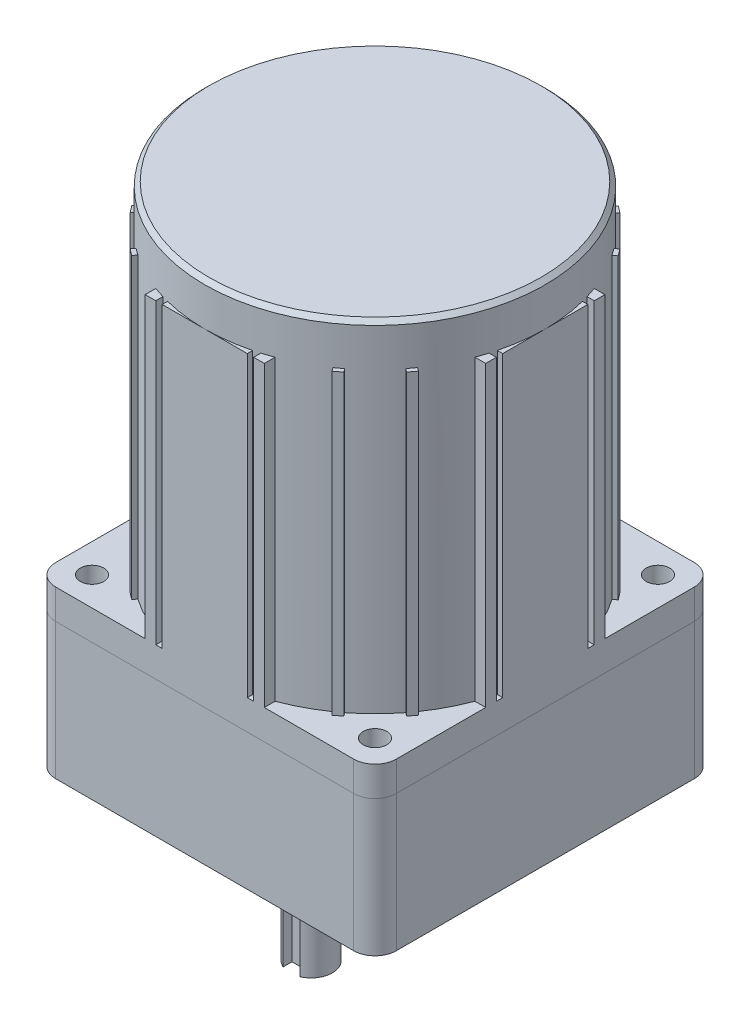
from build123d import *
from build123d.topology import SkipClean

# Parameters (mm, degrees)
SKETCH1_W            = 80
SKETCH1_H            = 80
BOSS_EXTRUDE1_DEPTH  = 87
SKETCH2_OUTSIDE_W    = 110.544
SKETCH2_OUTSIDE_H    = 110.544
SKETCH2_OUTSIDE_R    = 40
CUT_EXTRUDE1_DEPTH   = 10
SKETCH4_R            = 2.25
CUT_EXTRUDE2_DEPTH   = 20
SKETCH5_W            = 80
SKETCH5_H            = 80
BOSS_EXTRUDE2_DEPTH  = 32
SKETCH6_R            = 2.75
CUT_EXTRUDE3_DEPTH   = 165.198051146
SKETCH7_R            = 36.5
CUT_EXTRUDE4_DEPTH   = 2
SKETCH8_R            = 17
BOSS_EXTRUDE3_DEPTH  = 5
SKETCH9_R            = 5
BOSS_EXTRUDE4_DEPTH  = 29
FILLET1_R            = 5
CHAMFER1_SIZE        = 1
CUT_EXTRUDE6_DEPTH   = 70
MIRROR3_COPY_1_DEPTH = 70
FILLET3_R            = 5
CUT_EXTRUDE7_DEPTH   = 2.5


with BuildPart() as part:
    # Sketch1 → Boss-Extrude1 (new body)
    with BuildSketch(Plane(origin=(0, 0, 0), x_dir=(1, 0, 0), z_dir=(0, 1, 0))):
        with Locations((40, -40)):
            Rectangle(SKETCH1_W, SKETCH1_H)
    extrude(amount=BOSS_EXTRUDE1_DEPTH)

    # Sketch2 outside → Cut-Extrude1 (cut)
    with BuildSketch(Plane(origin=(0, 87, 0), x_dir=(1, 0, 0), z_dir=(0, 1, 0))):
        with Locations((40, -40)):
            Rectangle(SKETCH2_OUTSIDE_W, SKETCH2_OUTSIDE_H)
        with Locations(Location((40, -40, 0), (0, 0, 270))):
            Circle(SKETCH2_OUTSIDE_R, mode=Mode.SUBTRACT)
    extrude(amount=-CUT_EXTRUDE1_DEPTH, mode=Mode.SUBTRACT)

    # Sketch4 → Cut-Extrude2 (cut)
    with BuildSketch(Plane.XZ):
        with Locations(Location((64.748737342, 15.251262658, 0), (0, 0, 270))):
            Circle(SKETCH4_R)
        with Locations(Location((15.251262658, 15.251262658, 0), (0, 0, 90))):
            Circle(SKETCH4_R)
        with Locations(Location((15.251262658, 64.748737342, 0), (0, 0, 270))):
            Circle(SKETCH4_R)
        with Locations(Location((64.748737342, 64.748737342, 0), (0, 0, 90))):
            Circle(SKETCH4_R)
    extrude(amount=-CUT_EXTRUDE2_DEPTH, mode=Mode.SUBTRACT)


with BuildPart() as body_2:
    # Sketch5 → Boss-Extrude2 (new body)
    with BuildSketch(Plane(origin=(0, 0, 0), x_dir=(-1, 0, 0), z_dir=(0, -1, 0))):
        with Locations((-40, -40)):
            Rectangle(SKETCH5_W, SKETCH5_H)
    extrude(amount=BOSS_EXTRUDE2_DEPTH)


with BuildPart() as cut_extrude3_tool:
    # Sketch6 → Cut-Extrude3 (new, through all)
    with BuildSketch(Plane.XZ.offset(32)):
        with Locations(Location((6.765981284, 73.234018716, 0), (0, 0, 270))):
            Circle(SKETCH6_R)
        with Locations(Location((6.765981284, 6.765981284, 0), (0, 0, 270))):
            Circle(SKETCH6_R)
        with Locations(Location((73.234018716, 73.234018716, 0), (0, 0, 270))):
            Circle(SKETCH6_R)
        with Locations(Location((73.234018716, 6.765981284, 0), (0, 0, 270))):
            Circle(SKETCH6_R)
    extrude(amount=-CUT_EXTRUDE3_DEPTH)


with BuildPart() as part_1:
    add(part.part)

    # Cut-Extrude3: cut by cut_extrude3_tool
    add(cut_extrude3_tool.part, mode=Mode.SUBTRACT)

    # Chamfer1
    chamfer1_edges = [part_1.edges().sort_by_distance(p)[0] for p in [
        (40, 87, 0),
    ]]
    chamfer(chamfer1_edges, length=CHAMFER1_SIZE)

    # Sketch11 → Cut-Extrude6 (cut)
    with SkipClean():  # the faces are left unmerged after this step: merging them gives an invalid solid
        with BuildSketch(Plane(origin=(0, 77, 0), x_dir=(1, 0, 0), z_dir=(0, 1, 0))):
            with BuildLine():
                Line((0, 0), (0, -26))
                Line((0, -26), (2.53001201, -26))
                ThreePointArc((2.53001201, -26), (4.573898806, -21.426057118), (7.17349773, -17.143474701))
                Line((7.17349773, -17.143474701), (6.31282664, -16.54420432))
                Line((6.31282664, -16.54420432), (7.534265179, -14.960509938))
                Line((7.534265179, -14.960509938), (8.32611237, -15.571229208))
                ThreePointArc((8.32611237, -15.571229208), (11.687111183, -11.744375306), (15.507152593, -8.375635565))
                Line((15.507152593, -8.375635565), (14.894831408, -7.585026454))
                Line((14.894831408, -7.585026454), (16.47604963, -6.360384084))
                Line((16.47604963, -6.360384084), (17.077061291, -7.219840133))
                ThreePointArc((17.077061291, -7.219840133), (21.390204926, -4.59271929), (26, -2.53001201))
                Line((26, -2.53001201), (26, 0))
                Line((26, 0), (0, 0))
            make_face()
            with BuildLine():
                Line((0, -28.5), (0, -30))
                Line((0, -30), (1.270166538, -30))
                ThreePointArc((1.270166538, -30), (1.472169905, -29.247962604), (1.688774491, -28.5))
                Line((1.688774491, -28.5), (0, -28.5))
            make_face()
            with BuildLine():
                Line((30, -1.270166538), (30, 0))
                Line((30, 0), (28.5, 0))
                Line((28.5, 0), (28.5, -1.688774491))
                ThreePointArc((28.5, -1.688774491), (29.247962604, -1.472169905), (30, -1.270166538))
            make_face()
        cut_extrude6 = extrude(amount=-CUT_EXTRUDE6_DEPTH, mode=Mode.SUBTRACT)

    # Mirror1: Cut-Extrude6 across plane
    with SkipClean():  # the faces are left unmerged after this step: merging them gives an invalid solid
        add(cut_extrude6.mirror(Plane(origin=(40, 0, 0), x_dir=(0, 0, 1), z_dir=(1, 0, 0))), mode=Mode.SUBTRACT)

    # Mirror3: Cut-Extrude6 across plane
    with SkipClean():  # the faces are left unmerged after this step: merging them gives an invalid solid
        add(cut_extrude6.mirror(Plane(origin=(0, 0, 40), x_dir=(1, 0, 0), z_dir=(0, 0, -1))), mode=Mode.SUBTRACT)

    # Mirror3 copy 1 sketch → Mirror3 copy 1 (cut)
    with SkipClean():  # the faces are left unmerged after this step: merging them gives an invalid solid
        with BuildSketch(Plane(origin=(80, 77, 80), x_dir=(-1, 0, 0), z_dir=(0, 1, 0))):
            with BuildLine():
                Line((0, 0), (0, -26))
                Line((0, -26), (2.53001201, -26))
                ThreePointArc((2.53001201, -26), (4.573898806, -21.426057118), (7.17349773, -17.143474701))
                Line((7.17349773, -17.143474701), (6.31282664, -16.54420432))
                Line((6.31282664, -16.54420432), (7.534265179, -14.960509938))
                Line((7.534265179, -14.960509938), (8.32611237, -15.571229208))
                ThreePointArc((8.32611237, -15.571229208), (11.687111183, -11.744375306), (15.507152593, -8.375635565))
                Line((15.507152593, -8.375635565), (14.894831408, -7.585026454))
                Line((14.894831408, -7.585026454), (16.47604963, -6.360384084))
                Line((16.47604963, -6.360384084), (17.077061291, -7.219840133))
                ThreePointArc((17.077061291, -7.219840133), (21.390204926, -4.59271929), (26, -2.53001201))
                Line((26, -2.53001201), (26, 0))
                Line((26, 0), (0, 0))
            make_face()
            with BuildLine():
                Line((0, -28.5), (0, -30))
                Line((0, -30), (1.270166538, -30))
                ThreePointArc((1.270166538, -30), (1.472169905, -29.247962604), (1.688774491, -28.5))
                Line((1.688774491, -28.5), (0, -28.5))
            make_face()
            with BuildLine():
                Line((30, -1.270166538), (30, 0))
                Line((30, 0), (28.5, 0))
                Line((28.5, 0), (28.5, -1.688774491))
                ThreePointArc((28.5, -1.688774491), (29.247962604, -1.472169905), (30, -1.270166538))
            make_face()
        extrude(amount=-MIRROR3_COPY_1_DEPTH, mode=Mode.SUBTRACT)

    # Fillet3
    fillet3_edges = [part_1.edges().sort_by_distance(p)[0] for p in [
        (0, 3.5, 0),
        (80, 3.5, 0),
        (0, 3.5, 80),
        (80, 3.5, 80),
    ]]
    fillet(fillet3_edges, radius=FILLET3_R)


with BuildPart() as body_2_1:
    add(body_2.part)

    # Cut-Extrude3: cut by cut_extrude3_tool
    add(cut_extrude3_tool.part, mode=Mode.SUBTRACT)

    # Sketch7 → Cut-Extrude4 (cut)
    with BuildSketch(Plane.XZ.offset(32)):
        with Locations(Location((40, 40, 0), (0, 0, 270))):
            Circle(SKETCH7_R)
    extrude(amount=-CUT_EXTRUDE4_DEPTH, mode=Mode.SUBTRACT)

    # Sketch8 → Boss-Extrude3 (add)
    with BuildSketch(Plane.XZ.offset(30)):
        with Locations(Location((40, 55, 0), (0, 0, 270))):
            Circle(SKETCH8_R)
    extrude(amount=BOSS_EXTRUDE3_DEPTH)

    # Sketch9 → Boss-Extrude4 (add)
    with BuildSketch(Plane(origin=(0, -35, 0), x_dir=(-1, 0, 0), z_dir=(0, -1, 0))):
        with Locations(Location((-40, -55, 0), (0, 0, 270))):
            Circle(SKETCH9_R)
    extrude(amount=BOSS_EXTRUDE4_DEPTH)

    # Fillet1
    fillet1_edges = [body_2_1.edges().sort_by_distance(p)[0] for p in [
        (0, -16, 80),
        (80, -16, 80),
        (80, -16, 0),
        (0, -16, 0),
    ]]
    fillet(fillet1_edges, radius=FILLET1_R)

    # Sketch12 → Cut-Extrude7 (cut)
    with BuildSketch(Plane.XY.offset(60)):
        with BuildLine():
            Line((38, -64), (38, -41))
            ThreePointArc((38, -41), (40, -39), (42, -41))
            Line((42, -41), (42, -64))
            ThreePointArc((42, -64), (40, -66), (38, -64))
        make_face()
    extrude(amount=-CUT_EXTRUDE7_DEPTH, mode=Mode.SUBTRACT)


solid = Compound([part_1.part, body_2_1.part])
